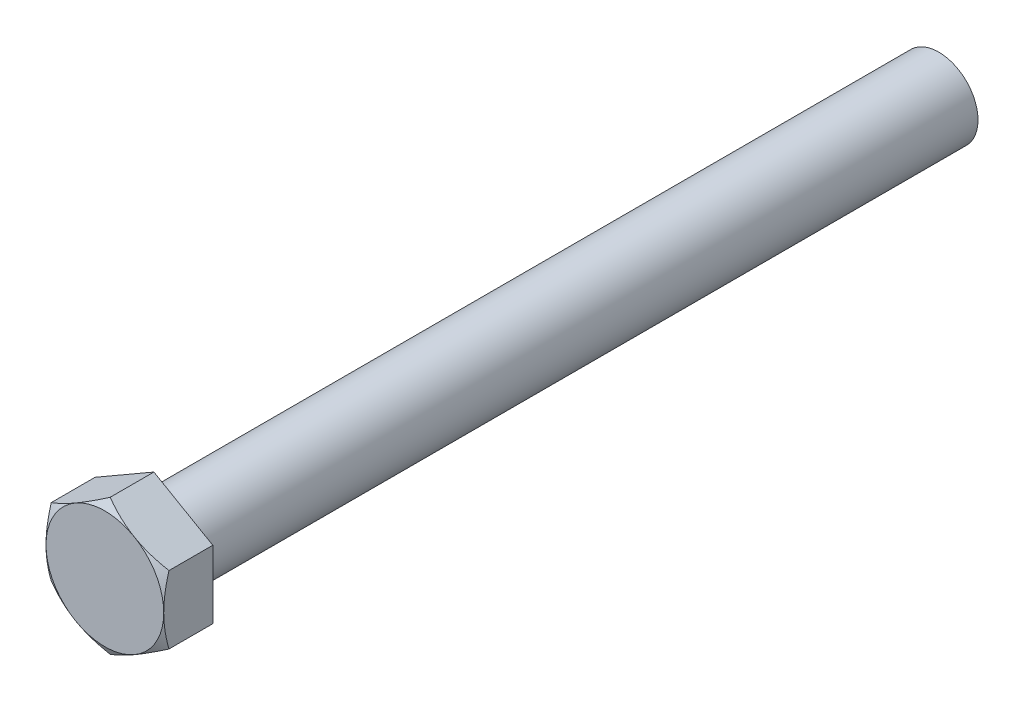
ISO-10303-21;
HEADER;
FILE_DESCRIPTION(('STEP AP214'),'2;1');
FILE_NAME('part.step','',(''),(''),'','','');
FILE_SCHEMA(('AUTOMOTIVE_DESIGN { 1 0 10303 214 1 1 1 1 }'));
ENDSEC;
DATA;
#1=APPLICATION_CONTEXT('core data for automotive mechanical design processes');
#2=APPLICATION_PROTOCOL_DEFINITION('international standard','automotive_design',2000,#1);
#3=PRODUCT_CONTEXT('',#1,'mechanical');
#4=PRODUCT('Part','Part','',(#3));
#5=PRODUCT_RELATED_PRODUCT_CATEGORY('part','',(#4));
#6=PRODUCT_DEFINITION_FORMATION('','',#4);
#7=PRODUCT_DEFINITION_CONTEXT('part definition',#1,'design');
#8=PRODUCT_DEFINITION('design','',#6,#7);
#9=PRODUCT_DEFINITION_SHAPE('','',#8);
#10=(LENGTH_UNIT() NAMED_UNIT(*) SI_UNIT(.MILLI.,.METRE.));
#11=(NAMED_UNIT(*) PLANE_ANGLE_UNIT() SI_UNIT($,.RADIAN.));
#12=(NAMED_UNIT(*) SI_UNIT($,.STERADIAN.) SOLID_ANGLE_UNIT());
#13=UNCERTAINTY_MEASURE_WITH_UNIT(LENGTH_MEASURE(1.E-05),#10,'distance_accuracy_value','');
#14=(GEOMETRIC_REPRESENTATION_CONTEXT(3) GLOBAL_UNCERTAINTY_ASSIGNED_CONTEXT((#13)) GLOBAL_UNIT_ASSIGNED_CONTEXT((#10,
#11,#12)) REPRESENTATION_CONTEXT('',''));
#15=CARTESIAN_POINT('',(0.,0.,0.));
#16=DIRECTION('',(0.,0.,1.));
#17=DIRECTION('',(1.,0.,0.));
#18=AXIS2_PLACEMENT_3D('',#15,#16,#17);
#19=CARTESIAN_POINT('',(18.,10.3923048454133,135.));
#20=DIRECTION('',(-0.5,-0.866025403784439,0.));
#21=DIRECTION('',(0.866025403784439,-0.5,0.));
#22=AXIS2_PLACEMENT_3D('',#19,#20,#21);
#23=PLANE('',#22);
#24=CARTESIAN_POINT('',(18.0002,10.3921893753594,133.392238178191));
#25=CARTESIAN_POINT('',(17.6045674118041,10.6206079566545,133.524106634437));
#26=CARTESIAN_POINT('',(17.2073916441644,10.8499174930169,133.649991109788));
#27=CARTESIAN_POINT('',(16.4098552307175,11.310375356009,133.888128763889));
#28=CARTESIAN_POINT('',(16.0094935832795,11.5415242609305,134.000377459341));
#29=CARTESIAN_POINT('',(15.2048116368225,12.0061075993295,134.209734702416));
#30=CARTESIAN_POINT('',(14.8004842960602,12.2395460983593,134.306807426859));
#31=CARTESIAN_POINT('',(13.9890201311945,12.7080451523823,134.483728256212));
#32=CARTESIAN_POINT('',(13.5818834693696,12.9431056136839,134.563577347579));
#33=CARTESIAN_POINT('',(12.7752328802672,13.4088255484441,134.702654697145));
#34=CARTESIAN_POINT('',(12.3757788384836,13.6394504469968,134.762343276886));
#35=CARTESIAN_POINT('',(11.5750403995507,14.1017570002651,134.862427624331));
#36=CARTESIAN_POINT('',(11.1737559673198,14.3334386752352,134.902823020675));
#37=CARTESIAN_POINT('',(10.370513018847,14.7971912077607,134.963301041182));
#38=CARTESIAN_POINT('',(9.96855587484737,15.0292612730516,134.983407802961));
#39=CARTESIAN_POINT('',(9.16427056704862,15.4936156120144,135.002876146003));
#40=CARTESIAN_POINT('',(8.76194241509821,15.7258998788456,135.002238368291));
#41=CARTESIAN_POINT('',(8.00978065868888,16.1601606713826,134.981666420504));
#42=CARTESIAN_POINT('',(7.65989346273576,16.3621681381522,134.964240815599));
#43=CARTESIAN_POINT('',(6.96095368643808,16.765701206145,134.914030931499));
#44=CARTESIAN_POINT('',(6.61190109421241,16.9672268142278,134.881246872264));
#45=CARTESIAN_POINT('',(5.91476277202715,17.3697198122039,134.800888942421));
#46=CARTESIAN_POINT('',(5.56667820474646,17.5706865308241,134.753301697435));
#47=CARTESIAN_POINT('',(4.87216610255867,17.9716632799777,134.644177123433));
#48=CARTESIAN_POINT('',(4.52573856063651,18.1716733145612,134.582639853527));
#49=CARTESIAN_POINT('',(3.47411308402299,18.7788295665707,134.375537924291));
#50=CARTESIAN_POINT('',(2.77196054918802,19.1842175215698,134.209322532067));
#51=CARTESIAN_POINT('',(1.37812528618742,19.9889486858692,133.832081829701));
#52=CARTESIAN_POINT('',(0.686424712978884,20.3883021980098,133.621145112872));
#53=CARTESIAN_POINT('',(-0.000199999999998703,20.7847251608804,133.392238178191));
#54=B_SPLINE_CURVE_WITH_KNOTS('',3,(#24,#25,#26,#27,#28,#29,#30,#31,#32,#33,#34,#35,#36,#37,#38,
#39,#40,#41,#42,#43,#44,#45,#46,#47,#48,#49,#50,#51,#52,#53),.UNSPECIFIED.,.F.,.F.,(4,2,2,2,2,2,
2,2,2,2,2,2,2,2,4),(0.,1.42650335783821,2.85347447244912,4.28376471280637,5.71397301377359,
7.10888071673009,8.50381526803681,9.8970882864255,11.2903182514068,12.5031974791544,
13.7160593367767,14.9300201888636,16.1439758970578,18.6253607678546,21.1018751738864),.UNSPECIFIED.);
#55=CARTESIAN_POINT('',(18.,10.3923048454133,133.392304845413));
#56=VERTEX_POINT('',#55);
#57=CARTESIAN_POINT('',(9.,15.5884572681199,135.));
#58=VERTEX_POINT('',#57);
#59=EDGE_CURVE('E115',#56,#58,#54,.T.);
#60=ORIENTED_EDGE('',*,*,#59,.F.);
#61=DIRECTION('',(0.,0.,-1.));
#62=VECTOR('',#61,1.);
#63=CARTESIAN_POINT('',(18.,10.3923048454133,135.));
#64=LINE('',#63,#62);
#65=CARTESIAN_POINT('',(18.,10.3923048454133,120.));
#66=VERTEX_POINT('',#65);
#67=EDGE_CURVE('E64',#56,#66,#64,.T.);
#68=ORIENTED_EDGE('',*,*,#67,.T.);
#69=DIRECTION('',(-0.866025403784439,0.5,0.));
#70=VECTOR('',#69,1.);
#71=CARTESIAN_POINT('',(18.,10.3923048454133,120.));
#72=LINE('',#71,#70);
#73=CARTESIAN_POINT('',(0.,20.7846096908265,120.));
#74=VERTEX_POINT('',#73);
#75=EDGE_CURVE('E122',#66,#74,#72,.T.);
#76=ORIENTED_EDGE('',*,*,#75,.T.);
#77=DIRECTION('',(0.,0.,-1.));
#78=VECTOR('',#77,1.);
#79=CARTESIAN_POINT('',(0.,20.7846096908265,135.));
#80=LINE('',#79,#78);
#81=CARTESIAN_POINT('',(0.,20.7846096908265,133.392304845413));
#82=VERTEX_POINT('',#81);
#83=EDGE_CURVE('E135',#82,#74,#80,.T.);
#84=ORIENTED_EDGE('',*,*,#83,.F.);
#85=EDGE_CURVE('E123',#58,#82,#54,.T.);
#86=ORIENTED_EDGE('',*,*,#85,.F.);
#87=EDGE_LOOP('',(#60,#68,#76,#84,#86));
#88=FACE_BOUND('',#87,.T.);
#89=ADVANCED_FACE('F41',(#88),#23,.F.);
#90=CARTESIAN_POINT('',(0.,20.7846096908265,135.));
#91=DIRECTION('',(0.5,-0.866025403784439,0.));
#92=DIRECTION('',(0.866025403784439,0.5,0.));
#93=AXIS2_PLACEMENT_3D('',#90,#91,#92);
#94=PLANE('',#93);
#95=CARTESIAN_POINT('',(0.00019999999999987,20.7847251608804,133.392238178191));
#96=CARTESIAN_POINT('',(-0.395432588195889,20.5563065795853,133.524106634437));
#97=CARTESIAN_POINT('',(-0.792608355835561,20.3269970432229,133.649991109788));
#98=CARTESIAN_POINT('',(-1.59014476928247,19.8665391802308,133.888128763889));
#99=CARTESIAN_POINT('',(-1.99050641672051,19.6353902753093,134.000377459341));
#100=CARTESIAN_POINT('',(-2.79518836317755,19.1708069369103,134.209734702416));
#101=CARTESIAN_POINT('',(-3.19951570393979,18.9373684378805,134.306807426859));
#102=CARTESIAN_POINT('',(-4.01097986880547,18.4688693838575,134.483728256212));
#103=CARTESIAN_POINT('',(-4.41811653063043,18.2338089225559,134.563577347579));
#104=CARTESIAN_POINT('',(-5.22476711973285,17.7680889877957,134.702654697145));
#105=CARTESIAN_POINT('',(-5.62422116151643,17.537464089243,134.762343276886));
#106=CARTESIAN_POINT('',(-6.42495960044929,17.0751575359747,134.862427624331));
#107=CARTESIAN_POINT('',(-6.82624403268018,16.8434758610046,134.902823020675));
#108=CARTESIAN_POINT('',(-7.62948698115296,16.3797233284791,134.963301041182));
#109=CARTESIAN_POINT('',(-8.03144412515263,16.1476532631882,134.983407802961));
#110=CARTESIAN_POINT('',(-8.83572943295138,15.6832989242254,135.002876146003));
#111=CARTESIAN_POINT('',(-9.23805758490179,15.4510146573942,135.002238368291));
#112=CARTESIAN_POINT('',(-9.99021934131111,15.0167538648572,134.981666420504));
#113=CARTESIAN_POINT('',(-10.3401065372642,14.8147463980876,134.964240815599));
#114=CARTESIAN_POINT('',(-11.0390463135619,14.4112133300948,134.914030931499));
#115=CARTESIAN_POINT('',(-11.3880989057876,14.209687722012,134.881246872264));
#116=CARTESIAN_POINT('',(-12.0852372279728,13.8071947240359,134.800888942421));
#117=CARTESIAN_POINT('',(-12.4333217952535,13.6062280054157,134.753301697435));
#118=CARTESIAN_POINT('',(-13.1278338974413,13.2052512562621,134.644177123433));
#119=CARTESIAN_POINT('',(-13.4742614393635,13.0052412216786,134.582639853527));
#120=CARTESIAN_POINT('',(-14.525886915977,12.3980849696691,134.375537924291));
#121=CARTESIAN_POINT('',(-15.228039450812,11.99269701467,134.209322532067));
#122=CARTESIAN_POINT('',(-16.6218747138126,11.1879658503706,133.832081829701));
#123=CARTESIAN_POINT('',(-17.3135752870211,10.78861233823,133.621145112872));
#124=CARTESIAN_POINT('',(-18.0002,10.3921893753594,133.392238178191));
#125=B_SPLINE_CURVE_WITH_KNOTS('',3,(#95,#96,#97,#98,#99,#100,#101,#102,#103,#104,#105,#106,
#107,#108,#109,#110,#111,#112,#113,#114,#115,#116,#117,#118,#119,#120,#121,#122,#123,#124),
.UNSPECIFIED.,.F.,.F.,(4,2,2,2,2,2,2,2,2,2,2,2,2,2,4),(0.,1.42650335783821,2.85347447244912,
4.28376471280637,5.71397301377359,7.10888071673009,8.50381526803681,9.8970882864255,
11.2903182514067,12.5031974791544,13.7160593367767,14.9300201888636,16.1439758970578,
18.6253607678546,21.1018751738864),.UNSPECIFIED.);
#126=CARTESIAN_POINT('',(-9.,15.5884572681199,135.));
#127=VERTEX_POINT('',#126);
#128=EDGE_CURVE('E128',#82,#127,#125,.T.);
#129=ORIENTED_EDGE('',*,*,#128,.F.);
#130=ORIENTED_EDGE('',*,*,#83,.T.);
#131=DIRECTION('',(-0.866025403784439,-0.5,0.));
#132=VECTOR('',#131,1.);
#133=CARTESIAN_POINT('',(0.,20.7846096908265,120.));
#134=LINE('',#133,#132);
#135=CARTESIAN_POINT('',(-18.,10.3923048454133,120.));
#136=VERTEX_POINT('',#135);
#137=EDGE_CURVE('E284',#74,#136,#134,.T.);
#138=ORIENTED_EDGE('',*,*,#137,.T.);
#139=DIRECTION('',(0.,0.,-1.));
#140=VECTOR('',#139,1.);
#141=CARTESIAN_POINT('',(-18.,10.3923048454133,135.));
#142=LINE('',#141,#140);
#143=CARTESIAN_POINT('',(-18.,10.3923048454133,133.392304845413));
#144=VERTEX_POINT('',#143);
#145=EDGE_CURVE('E207',#144,#136,#142,.T.);
#146=ORIENTED_EDGE('',*,*,#145,.F.);
#147=EDGE_CURVE('E136',#127,#144,#125,.T.);
#148=ORIENTED_EDGE('',*,*,#147,.F.);
#149=EDGE_LOOP('',(#129,#130,#138,#146,#148));
#150=FACE_BOUND('',#149,.T.);
#151=ADVANCED_FACE('F195',(#150),#94,.F.);
#152=CARTESIAN_POINT('',(-18.,10.3923048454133,135.));
#153=DIRECTION('',(1.,0.,0.));
#154=DIRECTION('',(0.,0.,-1.));
#155=AXIS2_PLACEMENT_3D('',#152,#153,#154);
#156=PLANE('',#155);
#157=CARTESIAN_POINT('',(-18.,-28.0352306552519,126.157144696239));
#158=CARTESIAN_POINT('',(-18.,-27.6415922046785,126.348383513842));
#159=CARTESIAN_POINT('',(-18.,-27.2474950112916,126.538677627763));
#160=CARTESIAN_POINT('',(-18.,-26.4582874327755,126.917162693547));
#161=CARTESIAN_POINT('',(-18.,-26.0631770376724,127.105353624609));
#162=CARTESIAN_POINT('',(-18.,-24.8760788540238,127.666499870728));
#163=CARTESIAN_POINT('',(-18.,-24.0824387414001,128.03597277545));
#164=CARTESIAN_POINT('',(-18.,-22.4856260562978,128.765382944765));
#165=CARTESIAN_POINT('',(-18.,-21.6824251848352,129.125258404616));
#166=CARTESIAN_POINT('',(-18.,-20.0696765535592,129.830444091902));
#167=CARTESIAN_POINT('',(-18.,-19.2601290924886,130.175755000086));
#168=CARTESIAN_POINT('',(-18.,-17.6070389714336,130.858853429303));
#169=CARTESIAN_POINT('',(-18.,-16.7632445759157,131.196034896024));
#170=CARTESIAN_POINT('',(-18.,-15.0658232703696,131.845169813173));
#171=CARTESIAN_POINT('',(-18.,-14.212195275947,132.157120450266));
#172=CARTESIAN_POINT('',(-18.,-12.4953343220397,132.74768929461));
#173=CARTESIAN_POINT('',(-18.,-11.6321243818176,133.026373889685));
#174=CARTESIAN_POINT('',(-18.,-9.89324259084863,133.541565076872));
#175=CARTESIAN_POINT('',(-18.,-9.01757471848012,133.778084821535));
#176=CARTESIAN_POINT('',(-18.,-7.6969343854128,134.092110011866));
#177=CARTESIAN_POINT('',(-18.,-7.25672922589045,134.189783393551));
#178=CARTESIAN_POINT('',(-18.,-6.37328878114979,134.370384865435));
#179=CARTESIAN_POINT('',(-18.,-5.93005355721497,134.453313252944));
#180=CARTESIAN_POINT('',(-18.,-5.04085986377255,134.602966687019));
#181=CARTESIAN_POINT('',(-18.,-4.59490150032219,134.669692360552));
#182=CARTESIAN_POINT('',(-18.,-3.70069703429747,134.785618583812));
#183=CARTESIAN_POINT('',(-18.,-3.25245093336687,134.834819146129));
#184=CARTESIAN_POINT('',(-18.,-2.36023194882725,134.914089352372));
#185=CARTESIAN_POINT('',(-18.,-1.91628090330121,134.944403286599));
#186=CARTESIAN_POINT('',(-18.,-1.02749516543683,134.986223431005));
#187=CARTESIAN_POINT('',(-18.,-0.58266048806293,134.997729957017));
#188=CARTESIAN_POINT('',(-18.,0.307101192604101,135.001661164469));
#189=CARTESIAN_POINT('',(-18.,0.752028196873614,134.994085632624));
#190=CARTESIAN_POINT('',(-18.,1.64116369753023,134.960038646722));
#191=CARTESIAN_POINT('',(-18.,2.08537216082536,134.933566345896));
#192=CARTESIAN_POINT('',(-18.,3.14910647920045,134.848112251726));
#193=CARTESIAN_POINT('',(-18.,3.76794184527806,134.780378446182));
#194=CARTESIAN_POINT('',(-18.,5.00110422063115,134.611894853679));
#195=CARTESIAN_POINT('',(-18.,5.6154306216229,134.511140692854));
#196=CARTESIAN_POINT('',(-18.,6.83895155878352,134.280200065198));
#197=CARTESIAN_POINT('',(-18.,7.44814188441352,134.149991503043));
#198=CARTESIAN_POINT('',(-18.,8.66045478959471,133.864119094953));
#199=CARTESIAN_POINT('',(-18.,9.26357745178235,133.708455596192));
#200=CARTESIAN_POINT('',(-18.,10.4775250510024,133.371646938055));
#201=CARTESIAN_POINT('',(-18.,11.088209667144,133.189999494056));
#202=CARTESIAN_POINT('',(-18.,12.3035613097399,132.807685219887));
#203=CARTESIAN_POINT('',(-18.,12.9082282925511,132.607018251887));
#204=CARTESIAN_POINT('',(-18.,14.1118504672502,132.189872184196));
#205=CARTESIAN_POINT('',(-18.,14.7108073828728,131.973398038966));
#206=CARTESIAN_POINT('',(-18.,15.6054979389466,131.638759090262));
#207=CARTESIAN_POINT('',(-18.,15.9031030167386,131.525558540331));
#208=CARTESIAN_POINT('',(-18.,16.4971429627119,131.296123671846));
#209=CARTESIAN_POINT('',(-18.,16.7935778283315,131.179889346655));
#210=CARTESIAN_POINT('',(-18.,17.5588127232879,130.875694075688));
#211=CARTESIAN_POINT('',(-18.,18.0267782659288,130.685632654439));
#212=CARTESIAN_POINT('',(-18.,18.9602024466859,130.299442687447));
#213=CARTESIAN_POINT('',(-18.,19.4256610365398,130.103314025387));
#214=CARTESIAN_POINT('',(-18.,20.818709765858,129.506993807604));
#215=CARTESIAN_POINT('',(-18.,21.742916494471,129.098890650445));
#216=CARTESIAN_POINT('',(-18.,23.5842732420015,128.266392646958));
#217=CARTESIAN_POINT('',(-18.,24.501420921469,127.841992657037));
#218=CARTESIAN_POINT('',(-18.,26.3297230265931,126.980575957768));
#219=CARTESIAN_POINT('',(-18.,27.2408776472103,126.54355966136));
#220=CARTESIAN_POINT('',(-18.,29.0595902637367,125.658918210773));
#221=CARTESIAN_POINT('',(-18.,29.9671414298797,125.211279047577));
#222=CARTESIAN_POINT('',(-18.,31.7782364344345,124.307963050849));
#223=CARTESIAN_POINT('',(-18.,32.6817802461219,123.852286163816));
#224=CARTESIAN_POINT('',(-18.,34.4853817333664,122.934491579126));
#225=CARTESIAN_POINT('',(-18.,35.3854400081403,122.472375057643));
#226=CARTESIAN_POINT('',(-18.,37.1827766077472,121.54277856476));
#227=CARTESIAN_POINT('',(-18.,38.0800549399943,121.07529860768));
#228=CARTESIAN_POINT('',(-18.,40.5927076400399,119.75829920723));
#229=CARTESIAN_POINT('',(-18.,42.2054625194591,118.903782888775));
#230=CARTESIAN_POINT('',(-18.,45.4254169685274,117.184175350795));
#231=CARTESIAN_POINT('',(-18.,47.0326162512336,116.319083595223));
#232=CARTESIAN_POINT('',(-18.,50.23788874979,114.583555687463));
#233=CARTESIAN_POINT('',(-18.,51.835974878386,113.713143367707));
#234=CARTESIAN_POINT('',(-18.,54.2305423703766,112.402977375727));
#235=CARTESIAN_POINT('',(-18.,55.0282776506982,111.965512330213));
#236=CARTESIAN_POINT('',(-18.,56.6229998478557,111.089222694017));
#237=CARTESIAN_POINT('',(-18.,57.4199867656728,110.65039810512));
#238=CARTESIAN_POINT('',(-18.,58.2166442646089,110.210976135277));
#239=B_SPLINE_CURVE_WITH_KNOTS('',3,(#157,#158,#159,#160,#161,#162,#163,#164,#165,#166,#167,
#168,#169,#170,#171,#172,#173,#174,#175,#176,#177,#178,#179,#180,#181,#182,#183,#184,#185,#186,
#187,#188,#189,#190,#191,#192,#193,#194,#195,#196,#197,#198,#199,#200,#201,#202,#203,#204,#205,
#206,#207,#208,#209,#210,#211,#212,#213,#214,#215,#216,#217,#218,#219,#220,#221,#222,#223,#224,
#225,#226,#227,#228,#229,#230,#231,#232,#233,#234,#235,#236,#237,#238),.UNSPECIFIED.,.F.,.F.,(4,
2,2,2,2,2,2,2,2,2,2,2,2,2,2,2,2,2,2,2,2,2,2,2,2,2,2,2,2,2,2,2,2,2,2,2,2,2,2,2,4),(0.,
1.31289964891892,2.62581227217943,5.25202016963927,7.89231989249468,10.5324960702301,
13.258196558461,15.9842005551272,18.7046700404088,21.42428943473,22.7768152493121,
24.1293137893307,25.4817599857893,26.8342052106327,28.1687727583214,29.5033178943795,
30.8378779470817,32.1724978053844,34.0390619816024,35.9058735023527,37.7740900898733,
39.6422811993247,41.5532931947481,43.4643190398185,45.3747484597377,46.3299568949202,
47.2851674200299,48.8003817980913,50.3156252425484,53.3462943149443,56.3779279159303,
59.4094624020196,62.445245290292,65.4810483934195,68.5163041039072,71.551551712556,
77.0269441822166,82.5026153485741,87.9618525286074,90.6912865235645,93.4207169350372),.UNSPECIFIED.);
#240=CARTESIAN_POINT('',(-18.,0.,135.));
#241=VERTEX_POINT('',#240);
#242=EDGE_CURVE('E189',#144,#241,#239,.F.);
#243=ORIENTED_EDGE('',*,*,#242,.F.);
#244=ORIENTED_EDGE('',*,*,#145,.T.);
#245=DIRECTION('',(0.,-1.,0.));
#246=VECTOR('',#245,1.);
#247=CARTESIAN_POINT('',(-18.,10.3923048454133,120.));
#248=LINE('',#247,#246);
#249=CARTESIAN_POINT('',(-18.,-10.3923048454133,120.));
#250=VERTEX_POINT('',#249);
#251=EDGE_CURVE('E225',#136,#250,#248,.T.);
#252=ORIENTED_EDGE('',*,*,#251,.T.);
#253=DIRECTION('',(0.,0.,-1.));
#254=VECTOR('',#253,1.);
#255=CARTESIAN_POINT('',(-18.,-10.3923048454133,135.));
#256=LINE('',#255,#254);
#257=CARTESIAN_POINT('',(-18.,-10.3923048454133,133.392304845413));
#258=VERTEX_POINT('',#257);
#259=EDGE_CURVE('E223',#258,#250,#256,.T.);
#260=ORIENTED_EDGE('',*,*,#259,.F.);
#261=EDGE_CURVE('E183',#241,#258,#239,.F.);
#262=ORIENTED_EDGE('',*,*,#261,.F.);
#263=EDGE_LOOP('',(#243,#244,#252,#260,#262));
#264=FACE_BOUND('',#263,.T.);
#265=ADVANCED_FACE('F191',(#264),#156,.F.);
#266=CARTESIAN_POINT('',(-18.,-10.3923048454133,135.));
#267=DIRECTION('',(0.5,0.866025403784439,0.));
#268=DIRECTION('',(-0.866025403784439,0.5,0.));
#269=AXIS2_PLACEMENT_3D('',#266,#267,#268);
#270=PLANE('',#269);
#271=CARTESIAN_POINT('',(-18.0002,-10.3921893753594,133.392238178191));
#272=CARTESIAN_POINT('',(-17.6045674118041,-10.6206079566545,133.524106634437));
#273=CARTESIAN_POINT('',(-17.2073916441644,-10.8499174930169,133.649991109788));
#274=CARTESIAN_POINT('',(-16.4098552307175,-11.310375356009,133.888128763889));
#275=CARTESIAN_POINT('',(-16.0094935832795,-11.5415242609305,134.000377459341));
#276=CARTESIAN_POINT('',(-15.2048116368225,-12.0061075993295,134.209734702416));
#277=CARTESIAN_POINT('',(-14.8004842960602,-12.2395460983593,134.306807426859));
#278=CARTESIAN_POINT('',(-13.9890201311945,-12.7080451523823,134.483728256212));
#279=CARTESIAN_POINT('',(-13.5818834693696,-12.9431056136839,134.563577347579));
#280=CARTESIAN_POINT('',(-12.7752328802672,-13.4088255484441,134.702654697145));
#281=CARTESIAN_POINT('',(-12.3757788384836,-13.6394504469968,134.762343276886));
#282=CARTESIAN_POINT('',(-11.5750403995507,-14.1017570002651,134.862427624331));
#283=CARTESIAN_POINT('',(-11.1737559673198,-14.3334386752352,134.902823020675));
#284=CARTESIAN_POINT('',(-10.3705130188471,-14.7971912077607,134.963301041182));
#285=CARTESIAN_POINT('',(-9.96855587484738,-15.0292612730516,134.983407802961));
#286=CARTESIAN_POINT('',(-9.16427056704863,-15.4936156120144,135.002876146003));
#287=CARTESIAN_POINT('',(-8.76194241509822,-15.7258998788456,135.002238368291));
#288=CARTESIAN_POINT('',(-8.00978065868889,-16.1601606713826,134.981666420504));
#289=CARTESIAN_POINT('',(-7.65989346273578,-16.3621681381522,134.964240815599));
#290=CARTESIAN_POINT('',(-6.96095368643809,-16.765701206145,134.914030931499));
#291=CARTESIAN_POINT('',(-6.61190109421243,-16.9672268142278,134.881246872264));
#292=CARTESIAN_POINT('',(-5.91476277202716,-17.3697198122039,134.800888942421));
#293=CARTESIAN_POINT('',(-5.56667820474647,-17.5706865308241,134.753301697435));
#294=CARTESIAN_POINT('',(-4.87216610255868,-17.9716632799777,134.644177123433));
#295=CARTESIAN_POINT('',(-4.52573856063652,-18.1716733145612,134.582639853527));
#296=CARTESIAN_POINT('',(-3.474113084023,-18.7788295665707,134.375537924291));
#297=CARTESIAN_POINT('',(-2.77196054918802,-19.1842175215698,134.209322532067));
#298=CARTESIAN_POINT('',(-1.37812528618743,-19.9889486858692,133.832081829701));
#299=CARTESIAN_POINT('',(-0.686424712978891,-20.3883021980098,133.621145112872));
#300=CARTESIAN_POINT('',(0.000199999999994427,-20.7847251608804,133.392238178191));
#301=B_SPLINE_CURVE_WITH_KNOTS('',3,(#271,#272,#273,#274,#275,#276,#277,#278,#279,#280,#281,
#282,#283,#284,#285,#286,#287,#288,#289,#290,#291,#292,#293,#294,#295,#296,#297,#298,#299,#300),
.UNSPECIFIED.,.F.,.F.,(4,2,2,2,2,2,2,2,2,2,2,2,2,2,4),(0.,1.42650335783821,2.85347447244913,
4.28376471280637,5.71397301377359,7.10888071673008,8.50381526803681,9.8970882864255,
11.2903182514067,12.5031974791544,13.7160593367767,14.9300201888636,16.1439758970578,
18.6253607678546,21.1018751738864),.UNSPECIFIED.);
#302=CARTESIAN_POINT('',(-9.,-15.5884572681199,135.));
#303=VERTEX_POINT('',#302);
#304=EDGE_CURVE('E190',#258,#303,#301,.T.);
#305=ORIENTED_EDGE('',*,*,#304,.F.);
#306=ORIENTED_EDGE('',*,*,#259,.T.);
#307=DIRECTION('',(0.866025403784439,-0.5,0.));
#308=VECTOR('',#307,1.);
#309=CARTESIAN_POINT('',(-18.,-10.3923048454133,120.));
#310=LINE('',#309,#308);
#311=CARTESIAN_POINT('',(0.,-20.7846096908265,120.));
#312=VERTEX_POINT('',#311);
#313=EDGE_CURVE('E282',#250,#312,#310,.T.);
#314=ORIENTED_EDGE('',*,*,#313,.T.);
#315=DIRECTION('',(0.,0.,-1.));
#316=VECTOR('',#315,1.);
#317=CARTESIAN_POINT('',(0.,-20.7846096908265,135.));
#318=LINE('',#317,#316);
#319=CARTESIAN_POINT('',(0.,-20.7846096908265,133.392304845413));
#320=VERTEX_POINT('',#319);
#321=EDGE_CURVE('E229',#320,#312,#318,.T.);
#322=ORIENTED_EDGE('',*,*,#321,.F.);
#323=EDGE_CURVE('E177',#303,#320,#301,.T.);
#324=ORIENTED_EDGE('',*,*,#323,.F.);
#325=EDGE_LOOP('',(#305,#306,#314,#322,#324));
#326=FACE_BOUND('',#325,.T.);
#327=ADVANCED_FACE('F194',(#326),#270,.F.);
#328=CARTESIAN_POINT('',(0.,-20.7846096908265,135.));
#329=DIRECTION('',(-0.5,0.866025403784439,0.));
#330=DIRECTION('',(-0.866025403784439,-0.5,0.));
#331=AXIS2_PLACEMENT_3D('',#328,#329,#330);
#332=PLANE('',#331);
#333=CARTESIAN_POINT('',(-0.000200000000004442,-20.7847251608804,133.392238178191));
#334=CARTESIAN_POINT('',(0.395432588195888,-20.5563065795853,133.524106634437));
#335=CARTESIAN_POINT('',(0.79260835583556,-20.3269970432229,133.649991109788));
#336=CARTESIAN_POINT('',(1.59014476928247,-19.8665391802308,133.888128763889));
#337=CARTESIAN_POINT('',(1.99050641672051,-19.6353902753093,134.000377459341));
#338=CARTESIAN_POINT('',(2.79518836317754,-19.1708069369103,134.209734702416));
#339=CARTESIAN_POINT('',(3.19951570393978,-18.9373684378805,134.306807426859));
#340=CARTESIAN_POINT('',(4.01097986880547,-18.4688693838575,134.483728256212));
#341=CARTESIAN_POINT('',(4.41811653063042,-18.2338089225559,134.563577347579));
#342=CARTESIAN_POINT('',(5.22476711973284,-17.7680889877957,134.702654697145));
#343=CARTESIAN_POINT('',(5.62422116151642,-17.537464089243,134.762343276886));
#344=CARTESIAN_POINT('',(6.42495960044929,-17.0751575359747,134.862427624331));
#345=CARTESIAN_POINT('',(6.82624403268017,-16.8434758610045,134.902823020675));
#346=CARTESIAN_POINT('',(7.62948698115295,-16.3797233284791,134.963301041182));
#347=CARTESIAN_POINT('',(8.03144412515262,-16.1476532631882,134.983407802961));
#348=CARTESIAN_POINT('',(8.83572943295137,-15.6832989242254,135.002876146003));
#349=CARTESIAN_POINT('',(9.23805758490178,-15.4510146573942,135.002238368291));
#350=CARTESIAN_POINT('',(9.9902193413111,-15.0167538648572,134.981666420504));
#351=CARTESIAN_POINT('',(10.3401065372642,-14.8147463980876,134.964240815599));
#352=CARTESIAN_POINT('',(11.0390463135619,-14.4112133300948,134.914030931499));
#353=CARTESIAN_POINT('',(11.3880989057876,-14.209687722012,134.881246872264));
#354=CARTESIAN_POINT('',(12.0852372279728,-13.8071947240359,134.800888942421));
#355=CARTESIAN_POINT('',(12.4333217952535,-13.6062280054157,134.753301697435));
#356=CARTESIAN_POINT('',(13.1278338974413,-13.2052512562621,134.644177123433));
#357=CARTESIAN_POINT('',(13.4742614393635,-13.0052412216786,134.582639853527));
#358=CARTESIAN_POINT('',(14.525886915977,-12.3980849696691,134.375537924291));
#359=CARTESIAN_POINT('',(15.228039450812,-11.99269701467,134.209322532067));
#360=CARTESIAN_POINT('',(16.6218747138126,-11.1879658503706,133.832081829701));
#361=CARTESIAN_POINT('',(17.3135752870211,-10.78861233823,133.621145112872));
#362=CARTESIAN_POINT('',(18.0002,-10.3921893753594,133.392238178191));
#363=B_SPLINE_CURVE_WITH_KNOTS('',3,(#333,#334,#335,#336,#337,#338,#339,#340,#341,#342,#343,
#344,#345,#346,#347,#348,#349,#350,#351,#352,#353,#354,#355,#356,#357,#358,#359,#360,#361,#362),
.UNSPECIFIED.,.F.,.F.,(4,2,2,2,2,2,2,2,2,2,2,2,2,2,4),(0.,1.42650335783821,2.85347447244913,
4.28376471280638,5.71397301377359,7.10888071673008,8.50381526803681,9.8970882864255,
11.2903182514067,12.5031974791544,13.7160593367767,14.9300201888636,16.1439758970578,
18.6253607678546,21.1018751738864),.UNSPECIFIED.);
#364=CARTESIAN_POINT('',(9.,-15.5884572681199,135.));
#365=VERTEX_POINT('',#364);
#366=EDGE_CURVE('E287',#320,#365,#363,.T.);
#367=ORIENTED_EDGE('',*,*,#366,.F.);
#368=ORIENTED_EDGE('',*,*,#321,.T.);
#369=DIRECTION('',(0.866025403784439,0.5,0.));
#370=VECTOR('',#369,1.);
#371=CARTESIAN_POINT('',(0.,-20.7846096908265,120.));
#372=LINE('',#371,#370);
#373=CARTESIAN_POINT('',(18.,-10.3923048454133,120.));
#374=VERTEX_POINT('',#373);
#375=EDGE_CURVE('E275',#312,#374,#372,.T.);
#376=ORIENTED_EDGE('',*,*,#375,.T.);
#377=DIRECTION('',(0.,0.,-1.));
#378=VECTOR('',#377,1.);
#379=CARTESIAN_POINT('',(18.,-10.3923048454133,135.));
#380=LINE('',#379,#378);
#381=CARTESIAN_POINT('',(18.,-10.3923048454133,133.392304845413));
#382=VERTEX_POINT('',#381);
#383=EDGE_CURVE('E232',#382,#374,#380,.T.);
#384=ORIENTED_EDGE('',*,*,#383,.F.);
#385=EDGE_CURVE('E169',#365,#382,#363,.T.);
#386=ORIENTED_EDGE('',*,*,#385,.F.);
#387=EDGE_LOOP('',(#367,#368,#376,#384,#386));
#388=FACE_BOUND('',#387,.T.);
#389=ADVANCED_FACE('F257',(#388),#332,.F.);
#390=CARTESIAN_POINT('',(18.,-10.3923048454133,135.));
#391=DIRECTION('',(-1.,0.,0.));
#392=DIRECTION('',(0.,-1.,0.));
#393=AXIS2_PLACEMENT_3D('',#390,#391,#392);
#394=PLANE('',#393);
#395=CARTESIAN_POINT('',(18.,-28.0352306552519,126.157144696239));
#396=CARTESIAN_POINT('',(18.,-27.6415922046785,126.348383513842));
#397=CARTESIAN_POINT('',(18.,-27.2474950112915,126.538677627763));
#398=CARTESIAN_POINT('',(18.,-26.4582874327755,126.917162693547));
#399=CARTESIAN_POINT('',(18.,-26.0631770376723,127.105353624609));
#400=CARTESIAN_POINT('',(18.,-24.8760788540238,127.666499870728));
#401=CARTESIAN_POINT('',(18.,-24.0824387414,128.03597277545));
#402=CARTESIAN_POINT('',(18.,-22.4856260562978,128.765382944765));
#403=CARTESIAN_POINT('',(18.,-21.6824251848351,129.125258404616));
#404=CARTESIAN_POINT('',(18.,-20.0696765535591,129.830444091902));
#405=CARTESIAN_POINT('',(18.,-19.2601290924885,130.175755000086));
#406=CARTESIAN_POINT('',(18.,-17.6070389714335,130.858853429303));
#407=CARTESIAN_POINT('',(18.,-16.7632445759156,131.196034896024));
#408=CARTESIAN_POINT('',(18.,-15.0658232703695,131.845169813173));
#409=CARTESIAN_POINT('',(18.,-14.212195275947,132.157120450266));
#410=CARTESIAN_POINT('',(18.,-12.4953343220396,132.74768929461));
#411=CARTESIAN_POINT('',(18.,-11.6321243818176,133.026373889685));
#412=CARTESIAN_POINT('',(18.,-9.89324259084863,133.541565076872));
#413=CARTESIAN_POINT('',(18.,-9.01757471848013,133.778084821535));
#414=CARTESIAN_POINT('',(18.,-7.69693438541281,134.092110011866));
#415=CARTESIAN_POINT('',(18.,-7.25672922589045,134.189783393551));
#416=CARTESIAN_POINT('',(18.,-6.3732887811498,134.370384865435));
#417=CARTESIAN_POINT('',(18.,-5.93005355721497,134.453313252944));
#418=CARTESIAN_POINT('',(18.,-5.04085986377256,134.602966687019));
#419=CARTESIAN_POINT('',(18.,-4.5949015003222,134.669692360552));
#420=CARTESIAN_POINT('',(18.,-3.70069703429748,134.785618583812));
#421=CARTESIAN_POINT('',(18.,-3.25245093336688,134.834819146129));
#422=CARTESIAN_POINT('',(18.,-2.36023194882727,134.914089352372));
#423=CARTESIAN_POINT('',(18.,-1.91628090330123,134.944403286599));
#424=CARTESIAN_POINT('',(18.,-1.02749516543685,134.986223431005));
#425=CARTESIAN_POINT('',(18.,-0.582660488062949,134.997729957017));
#426=CARTESIAN_POINT('',(18.,0.30710119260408,135.001661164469));
#427=CARTESIAN_POINT('',(18.,0.752028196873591,134.994085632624));
#428=CARTESIAN_POINT('',(18.,1.6411636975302,134.960038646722));
#429=CARTESIAN_POINT('',(18.,2.08537216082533,134.933566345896));
#430=CARTESIAN_POINT('',(18.,3.14910647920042,134.848112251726));
#431=CARTESIAN_POINT('',(18.,3.76794184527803,134.780378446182));
#432=CARTESIAN_POINT('',(18.,5.00110422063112,134.611894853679));
#433=CARTESIAN_POINT('',(18.,5.61543062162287,134.511140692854));
#434=CARTESIAN_POINT('',(18.,6.83895155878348,134.280200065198));
#435=CARTESIAN_POINT('',(18.,7.44814188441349,134.149991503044));
#436=CARTESIAN_POINT('',(18.,8.66045478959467,133.864119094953));
#437=CARTESIAN_POINT('',(18.,9.26357745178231,133.708455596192));
#438=CARTESIAN_POINT('',(18.,10.4775250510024,133.371646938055));
#439=CARTESIAN_POINT('',(18.,11.0882096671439,133.189999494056));
#440=CARTESIAN_POINT('',(18.,12.3035613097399,132.807685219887));
#441=CARTESIAN_POINT('',(18.,12.9082282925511,132.607018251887));
#442=CARTESIAN_POINT('',(18.,14.1118504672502,132.189872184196));
#443=CARTESIAN_POINT('',(18.,14.7108073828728,131.973398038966));
#444=CARTESIAN_POINT('',(18.,15.6054979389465,131.638759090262));
#445=CARTESIAN_POINT('',(18.,15.9031030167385,131.525558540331));
#446=CARTESIAN_POINT('',(18.,16.4971429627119,131.296123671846));
#447=CARTESIAN_POINT('',(18.,16.7935778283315,131.179889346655));
#448=CARTESIAN_POINT('',(18.,17.5588127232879,130.875694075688));
#449=CARTESIAN_POINT('',(18.,18.0267782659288,130.68563265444));
#450=CARTESIAN_POINT('',(18.,18.9602024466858,130.299442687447));
#451=CARTESIAN_POINT('',(18.,19.4256610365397,130.103314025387));
#452=CARTESIAN_POINT('',(18.,20.818709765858,129.506993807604));
#453=CARTESIAN_POINT('',(18.,21.7429164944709,129.098890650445));
#454=CARTESIAN_POINT('',(18.,23.5842732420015,128.266392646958));
#455=CARTESIAN_POINT('',(18.,24.5014209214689,127.841992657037));
#456=CARTESIAN_POINT('',(18.,26.329723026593,126.980575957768));
#457=CARTESIAN_POINT('',(18.,27.2408776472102,126.54355966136));
#458=CARTESIAN_POINT('',(18.,29.0595902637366,125.658918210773));
#459=CARTESIAN_POINT('',(18.,29.9671414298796,125.211279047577));
#460=CARTESIAN_POINT('',(18.,31.7782364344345,124.307963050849));
#461=CARTESIAN_POINT('',(18.,32.6817802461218,123.852286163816));
#462=CARTESIAN_POINT('',(18.,34.4853817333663,122.934491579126));
#463=CARTESIAN_POINT('',(18.,35.3854400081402,122.472375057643));
#464=CARTESIAN_POINT('',(18.,37.1827766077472,121.54277856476));
#465=CARTESIAN_POINT('',(18.,38.0800549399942,121.07529860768));
#466=CARTESIAN_POINT('',(18.,40.5927076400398,119.75829920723));
#467=CARTESIAN_POINT('',(18.,42.205462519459,118.903782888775));
#468=CARTESIAN_POINT('',(18.,45.4254169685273,117.184175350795));
#469=CARTESIAN_POINT('',(18.,47.0326162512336,116.319083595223));
#470=CARTESIAN_POINT('',(18.,50.23788874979,114.583555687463));
#471=CARTESIAN_POINT('',(18.,51.8359748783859,113.713143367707));
#472=CARTESIAN_POINT('',(18.,54.2305423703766,112.402977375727));
#473=CARTESIAN_POINT('',(18.,55.0282776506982,111.965512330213));
#474=CARTESIAN_POINT('',(18.,56.6229998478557,111.089222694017));
#475=CARTESIAN_POINT('',(18.,57.4199867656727,110.65039810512));
#476=CARTESIAN_POINT('',(18.,58.2166442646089,110.210976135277));
#477=B_SPLINE_CURVE_WITH_KNOTS('',3,(#395,#396,#397,#398,#399,#400,#401,#402,#403,#404,#405,
#406,#407,#408,#409,#410,#411,#412,#413,#414,#415,#416,#417,#418,#419,#420,#421,#422,#423,#424,
#425,#426,#427,#428,#429,#430,#431,#432,#433,#434,#435,#436,#437,#438,#439,#440,#441,#442,#443,
#444,#445,#446,#447,#448,#449,#450,#451,#452,#453,#454,#455,#456,#457,#458,#459,#460,#461,#462,
#463,#464,#465,#466,#467,#468,#469,#470,#471,#472,#473,#474,#475,#476),.UNSPECIFIED.,.F.,.F.,(4,
2,2,2,2,2,2,2,2,2,2,2,2,2,2,2,2,2,2,2,2,2,2,2,2,2,2,2,2,2,2,2,2,2,2,2,2,2,2,2,4),(0.,
1.31289964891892,2.62581227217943,5.25202016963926,7.89231989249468,10.5324960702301,
13.258196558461,15.9842005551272,18.7046700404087,21.42428943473,22.7768152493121,
24.1293137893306,25.4817599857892,26.8342052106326,28.1687727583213,29.5033178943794,
30.8378779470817,32.1724978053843,34.0390619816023,35.9058735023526,37.7740900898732,
39.6422811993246,41.553293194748,43.4643190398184,45.3747484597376,46.32995689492,
47.2851674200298,48.8003817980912,50.3156252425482,53.3462943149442,56.3779279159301,
59.4094624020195,62.4452452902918,65.4810483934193,68.516304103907,71.5515517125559,
77.0269441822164,82.502615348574,87.9618525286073,90.6912865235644,93.4207169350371),.UNSPECIFIED.);
#478=CARTESIAN_POINT('',(18.,0.,135.));
#479=VERTEX_POINT('',#478);
#480=EDGE_CURVE('E268',#382,#479,#477,.T.);
#481=ORIENTED_EDGE('',*,*,#480,.F.);
#482=ORIENTED_EDGE('',*,*,#383,.T.);
#483=DIRECTION('',(0.,1.,0.));
#484=VECTOR('',#483,1.);
#485=CARTESIAN_POINT('',(18.,-10.3923048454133,120.));
#486=LINE('',#485,#484);
#487=EDGE_CURVE('E277',#374,#66,#486,.T.);
#488=ORIENTED_EDGE('',*,*,#487,.T.);
#489=ORIENTED_EDGE('',*,*,#67,.F.);
#490=EDGE_CURVE('E120',#479,#56,#477,.T.);
#491=ORIENTED_EDGE('',*,*,#490,.F.);
#492=EDGE_LOOP('',(#481,#482,#488,#489,#491));
#493=FACE_BOUND('',#492,.T.);
#494=ADVANCED_FACE('F252',(#493),#394,.F.);
#495=CARTESIAN_POINT('',(0.,0.,120.));
#496=DIRECTION('',(0.,0.,-1.));
#497=DIRECTION('',(-1.,0.,0.));
#498=AXIS2_PLACEMENT_3D('',#495,#496,#497);
#499=CYLINDRICAL_SURFACE('',#498,12.);
#500=CARTESIAN_POINT('',(0.,0.,120.));
#501=DIRECTION('',(0.,0.,1.));
#502=DIRECTION('',(1.,0.,0.));
#503=AXIS2_PLACEMENT_3D('',#500,#501,#502);
#504=CIRCLE('',#503,12.);
#505=CARTESIAN_POINT('',(12.,0.,120.));
#506=VERTEX_POINT('',#505);
#507=EDGE_CURVE('E238',#506,#506,#504,.T.);
#508=ORIENTED_EDGE('',*,*,#507,.F.);
#509=EDGE_LOOP('',(#508));
#510=FACE_BOUND('',#509,.T.);
#511=CARTESIAN_POINT('',(0.,0.,-120.));
#512=DIRECTION('',(0.,0.,1.));
#513=DIRECTION('',(1.,0.,0.));
#514=AXIS2_PLACEMENT_3D('',#511,#512,#513);
#515=CIRCLE('',#514,12.);
#516=CARTESIAN_POINT('',(12.,0.,-120.));
#517=VERTEX_POINT('',#516);
#518=EDGE_CURVE('E237',#517,#517,#515,.T.);
#519=ORIENTED_EDGE('',*,*,#518,.T.);
#520=EDGE_LOOP('',(#519));
#521=FACE_BOUND('',#520,.T.);
#522=ADVANCED_FACE('F43',(#510,#521),#499,.T.);
#523=CARTESIAN_POINT('',(0.,0.,-120.));
#524=DIRECTION('',(0.,0.,1.));
#525=DIRECTION('',(1.,0.,0.));
#526=AXIS2_PLACEMENT_3D('',#523,#524,#525);
#527=PLANE('',#526);
#528=ORIENTED_EDGE('',*,*,#518,.F.);
#529=EDGE_LOOP('',(#528));
#530=FACE_BOUND('',#529,.T.);
#531=ADVANCED_FACE('F244',(#530),#527,.F.);
#532=CARTESIAN_POINT('',(0.,20.7846096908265,120.));
#533=DIRECTION('',(0.,0.,1.));
#534=DIRECTION('',(1.,0.,0.));
#535=AXIS2_PLACEMENT_3D('',#532,#533,#534);
#536=PLANE('',#535);
#537=ORIENTED_EDGE('',*,*,#75,.F.);
#538=ORIENTED_EDGE('',*,*,#487,.F.);
#539=ORIENTED_EDGE('',*,*,#375,.F.);
#540=ORIENTED_EDGE('',*,*,#313,.F.);
#541=ORIENTED_EDGE('',*,*,#251,.F.);
#542=ORIENTED_EDGE('',*,*,#137,.F.);
#543=EDGE_LOOP('',(#537,#538,#539,#540,#541,#542));
#544=FACE_BOUND('',#543,.T.);
#545=ORIENTED_EDGE('',*,*,#507,.T.);
#546=EDGE_LOOP('',(#545));
#547=FACE_BOUND('',#546,.T.);
#548=ADVANCED_FACE('F246',(#544,#547),#536,.F.);
#549=CARTESIAN_POINT('',(0.,0.,135.));
#550=DIRECTION('',(0.,0.,-1.));
#551=DIRECTION('',(1.,0.,0.));
#552=AXIS2_PLACEMENT_3D('',#549,#550,#551);
#553=CONICAL_SURFACE('',#552,18.,1.0471975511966);
#554=ORIENTED_EDGE('',*,*,#385,.T.);
#555=ORIENTED_EDGE('',*,*,#480,.T.);
#556=CARTESIAN_POINT('',(0.,0.,135.));
#557=DIRECTION('',(0.,0.,1.));
#558=DIRECTION('',(1.,0.,0.));
#559=AXIS2_PLACEMENT_3D('',#556,#557,#558);
#560=CIRCLE('',#559,18.);
#561=EDGE_CURVE('E45',#365,#479,#560,.T.);
#562=ORIENTED_EDGE('',*,*,#561,.F.);
#563=EDGE_LOOP('',(#554,#555,#562));
#564=FACE_BOUND('',#563,.T.);
#565=ADVANCED_FACE('F156',(#564),#553,.T.);
#566=ORIENTED_EDGE('',*,*,#323,.T.);
#567=ORIENTED_EDGE('',*,*,#366,.T.);
#568=EDGE_CURVE('E220',#303,#365,#560,.T.);
#569=ORIENTED_EDGE('',*,*,#568,.F.);
#570=EDGE_LOOP('',(#566,#567,#569));
#571=FACE_BOUND('',#570,.T.);
#572=ADVANCED_FACE('F289',(#571),#553,.T.);
#573=ORIENTED_EDGE('',*,*,#261,.T.);
#574=ORIENTED_EDGE('',*,*,#304,.T.);
#575=EDGE_CURVE('E215',#241,#303,#560,.T.);
#576=ORIENTED_EDGE('',*,*,#575,.F.);
#577=EDGE_LOOP('',(#573,#574,#576));
#578=FACE_BOUND('',#577,.T.);
#579=ADVANCED_FACE('F216',(#578),#553,.T.);
#580=ORIENTED_EDGE('',*,*,#147,.T.);
#581=ORIENTED_EDGE('',*,*,#242,.T.);
#582=EDGE_CURVE('E50',#127,#241,#560,.T.);
#583=ORIENTED_EDGE('',*,*,#582,.F.);
#584=EDGE_LOOP('',(#580,#581,#583));
#585=FACE_BOUND('',#584,.T.);
#586=ADVANCED_FACE('F211',(#585),#553,.T.);
#587=ORIENTED_EDGE('',*,*,#85,.T.);
#588=ORIENTED_EDGE('',*,*,#128,.T.);
#589=EDGE_CURVE('E12',#58,#127,#560,.T.);
#590=ORIENTED_EDGE('',*,*,#589,.F.);
#591=EDGE_LOOP('',(#587,#588,#590));
#592=FACE_BOUND('',#591,.T.);
#593=ADVANCED_FACE('F126',(#592),#553,.T.);
#594=ORIENTED_EDGE('',*,*,#59,.T.);
#595=CARTESIAN_POINT('',(0.,0.,135.));
#596=DIRECTION('',(0.,0.,1.));
#597=DIRECTION('',(1.,0.,0.));
#598=AXIS2_PLACEMENT_3D('',#595,#596,#597);
#599=CIRCLE('',#598,18.);
#600=EDGE_CURVE('E118',#479,#58,#599,.T.);
#601=ORIENTED_EDGE('',*,*,#600,.F.);
#602=ORIENTED_EDGE('',*,*,#490,.T.);
#603=EDGE_LOOP('',(#594,#601,#602));
#604=FACE_BOUND('',#603,.T.);
#605=ADVANCED_FACE('F117',(#604),#553,.T.);
#606=CARTESIAN_POINT('',(0.,20.7846096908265,135.));
#607=DIRECTION('',(0.,0.,1.));
#608=DIRECTION('',(1.,0.,0.));
#609=AXIS2_PLACEMENT_3D('',#606,#607,#608);
#610=PLANE('',#609);
#611=ORIENTED_EDGE('',*,*,#561,.T.);
#612=ORIENTED_EDGE('',*,*,#600,.T.);
#613=ORIENTED_EDGE('',*,*,#589,.T.);
#614=ORIENTED_EDGE('',*,*,#582,.T.);
#615=ORIENTED_EDGE('',*,*,#575,.T.);
#616=ORIENTED_EDGE('',*,*,#568,.T.);
#617=EDGE_LOOP('',(#611,#612,#613,#614,#615,#616));
#618=FACE_BOUND('',#617,.T.);
#619=ADVANCED_FACE('F132',(#618),#610,.T.);
#620=CLOSED_SHELL('',(#89,#151,#265,#327,#389,#494,#522,#531,#548,#565,#572,#579,#586,#593,#605,#619));
#621=MANIFOLD_SOLID_BREP('B2',#620);
#622=ADVANCED_BREP_SHAPE_REPRESENTATION('',(#18,#621),#14);
#623=SHAPE_DEFINITION_REPRESENTATION(#9,#622);
ENDSEC;
END-ISO-10303-21;
